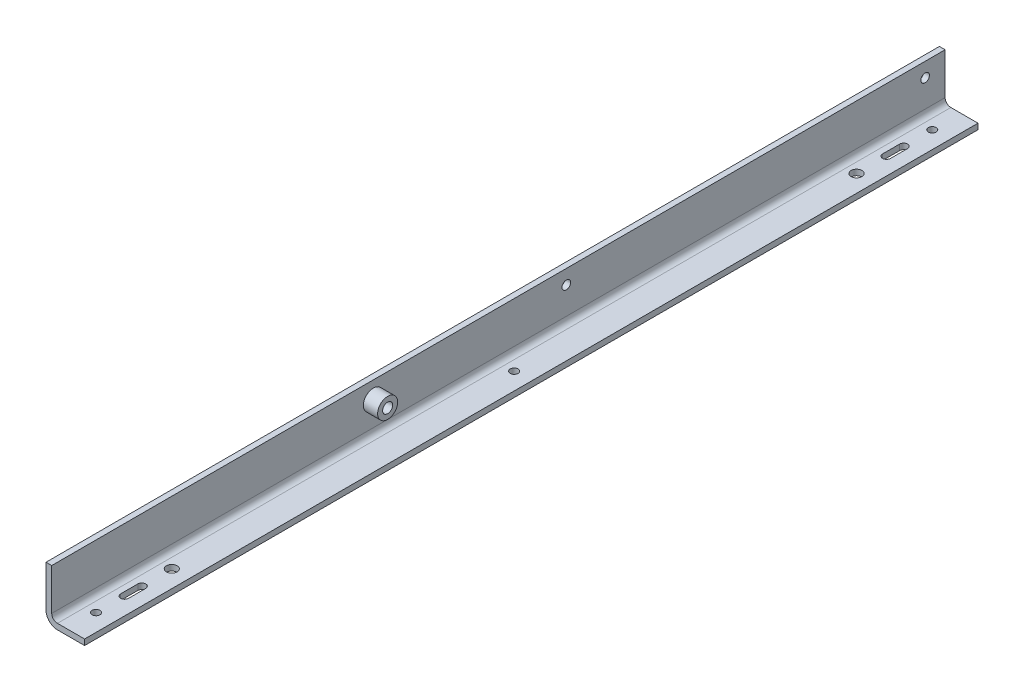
from build123d import *

# Parameters (mm, degrees)
EXTRUDE_1_DEPTH     = 625
SKETCH_2_R          = 3
SKETCH_2_R_2        = 3.5
CUT_EXTRUDE_1_DEPTH = 627.516560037
EXTRUDE_START       = 10
SKETCH_3_R          = 7
SKETCH_3_R_2        = 3.5
EXTRUDE_2_DEPTH     = 10
SKETCH_4_R          = 2.75
SKETCH_4_R_2        = 3.75
CUT_EXTRUDE_2_DEPTH = 627.67615241


with BuildPart() as part:
    # Sketch 1 → Extrude 1 (new body)
    with BuildSketch(Plane.XY):
        with BuildLine():
            Line((8, 4), (27, 4))
            Line((27, 4), (27, 0))
            Line((27, 0), (8, 0))
            ThreePointArc((8, 0), (2.343145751, 2.343145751), (0, 8))
            Line((0, 8), (0, 37))
            Line((0, 37), (4, 37))
            Line((4, 37), (4, 8))
            ThreePointArc((4, 8), (5.171572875, 5.171572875), (8, 4))
        make_face()
    extrude(amount=EXTRUDE_1_DEPTH)

    # Sketch 2 → Cut-Extrude 1 (cut, through all)
    with BuildSketch(Plane(origin=(4, 0, 0), x_dir=(0, 0, -1), z_dir=(1, 0, 0))):
        with Locations((-265, 27)):
            Circle(SKETCH_2_R)
        with Locations((-14, 27)):
            Circle(SKETCH_2_R)
        with Locations((-400, 25)):
            Circle(SKETCH_2_R_2)
    extrude(amount=-CUT_EXTRUDE_1_DEPTH, mode=Mode.SUBTRACT)

    # Sketch 3 → Extrude 2 (add)
    with BuildSketch(Plane(origin=(4, 0, 0), x_dir=(0, 0, -1), z_dir=(1, 0, 0)).offset(EXTRUDE_START)):
        with Locations(Location((-400, 25, 0), (0, 0, 180))):
            Circle(SKETCH_3_R)
        with Locations((-400, 25)):
            Circle(SKETCH_3_R_2, mode=Mode.SUBTRACT)
    extrude(amount=-EXTRUDE_2_DEPTH)

    # Sketch 4 → Cut-Extrude 2 (cut, through all)
    with BuildSketch(Plane.XZ):
        with Locations(Location((15, 605, 0), (0, 0, 270))):
            Circle(SKETCH_4_R)
        with Locations(Location((15, 552, 0), (0, 0, 270))):
            Circle(SKETCH_4_R_2)
        with Locations(Location((15, 312.5, 0), (0, 0, 270))):
            Circle(SKETCH_4_R)
        with Locations(Location((15, 73, 0), (0, 0, 270))):
            Circle(SKETCH_4_R_2)
        with Locations(Location((15, 20, 0), (0, 0, 270))):
            Circle(SKETCH_4_R)
        with BuildLine():
            Line((17.75, 585), (17.75, 573))
            ThreePointArc((17.75, 573), (15, 570.25), (12.25, 573))
            Line((12.25, 573), (12.25, 585))
            ThreePointArc((12.25, 585), (15, 587.75), (17.75, 585))
        make_face()
        with BuildLine():
            Line((17.75, 40), (17.75, 52))
            ThreePointArc((17.75, 52), (15, 54.75), (12.25, 52))
            Line((12.25, 52), (12.25, 40))
            ThreePointArc((12.25, 40), (15, 37.25), (17.75, 40))
        make_face()
    extrude(amount=-CUT_EXTRUDE_2_DEPTH, mode=Mode.SUBTRACT)


solid = part.part
